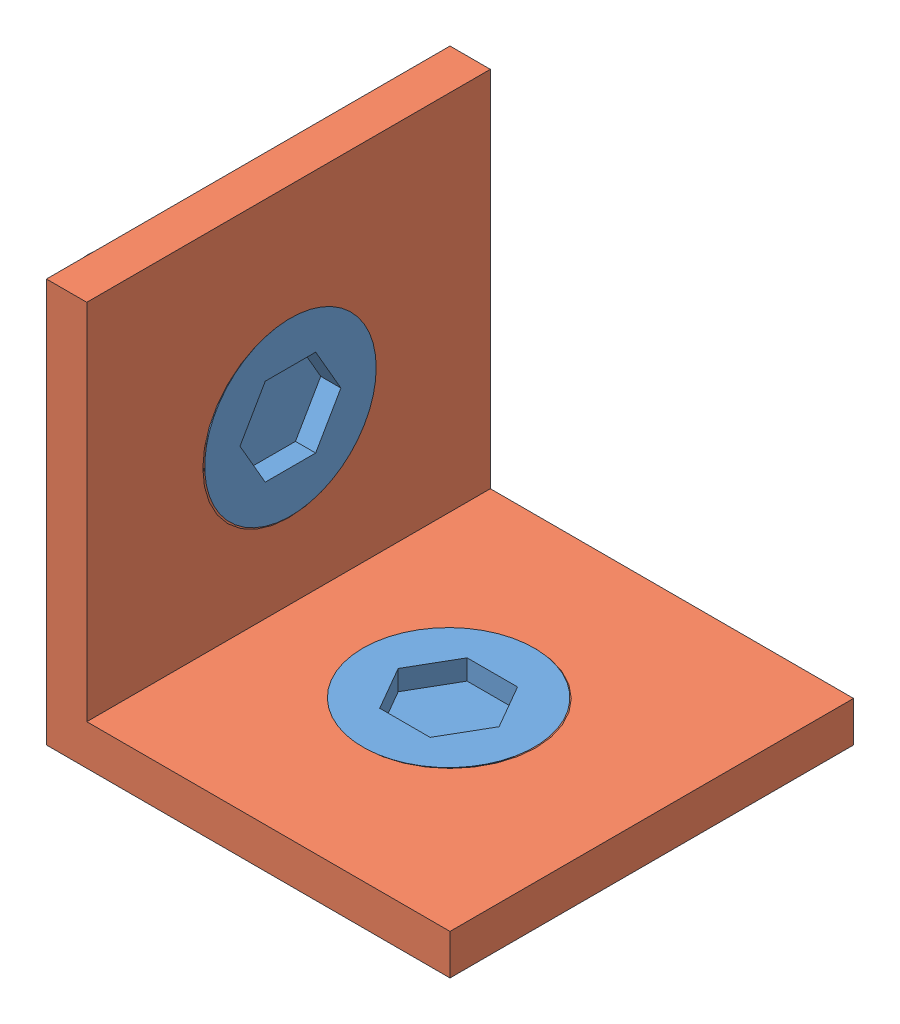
SolidWorks assembly X-Angulo con tornillos.SLDASM, configuration Predeterminado (file format 3800). Lengths in mm.
Overall size (55.92 55.89 40).
3 component instances, 2 part files, 0 mates.
Components (placement in the parent):
- X-Tornillos abellanados  M8 x16-1: X-Tornillos abellanados  M8 x16.SLDPRT [Predeterminado] at (19.9756 -15.8873 20.1118) size (17 20 17)
- X-Angulo 40x40 L (0.0.196.87)-1: X-Angulo 40x40 L (0.0.196.87).SLDPRT [Predeterminado] at origin size (40 40 40)
- X-Tornillos abellanados  M8 x16-2: X-Tornillos abellanados  M8 x16.SLDPRT [Predeterminado] at (-15.9177 20.1326 19.8969) x (0 0 1) z (0 1 0) size (17 20 17)
